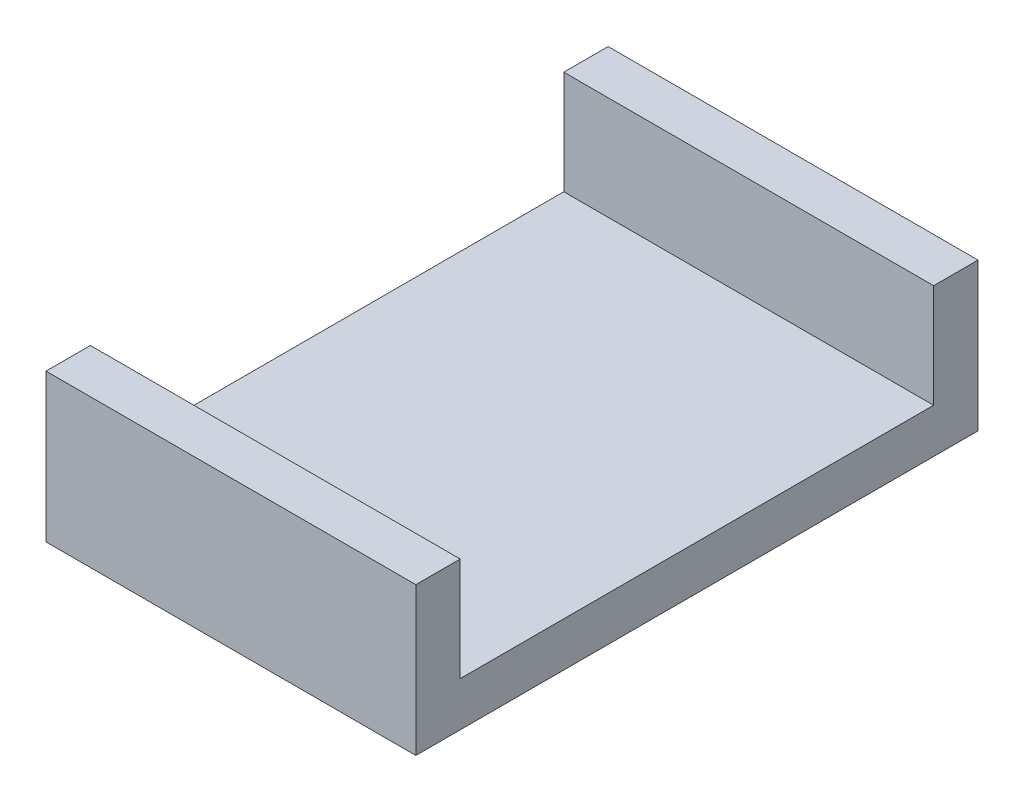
from build123d import *

# Parameters (mm, degrees)
BOSS_EXTRUDE1_DEPTH = 25


with BuildPart() as part:
    # Sketch1 → Boss-Extrude1 (new body)
    with BuildSketch(Plane(origin=(0, 0, 0), x_dir=(0, 0, -1), z_dir=(1, 0, 0))):
        Polygon((-38.513054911, 22.792501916), (-6.513054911, 22.792501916), (-6.513054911, 29.792501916), (-3.513054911, 29.792501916), (-3.513054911, 19.792501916), (-41.513054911, 19.792501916), (-41.513054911, 29.792501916), (-38.513054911, 29.792501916), align=None)
    extrude(amount=BOSS_EXTRUDE1_DEPTH)


solid = part.part
